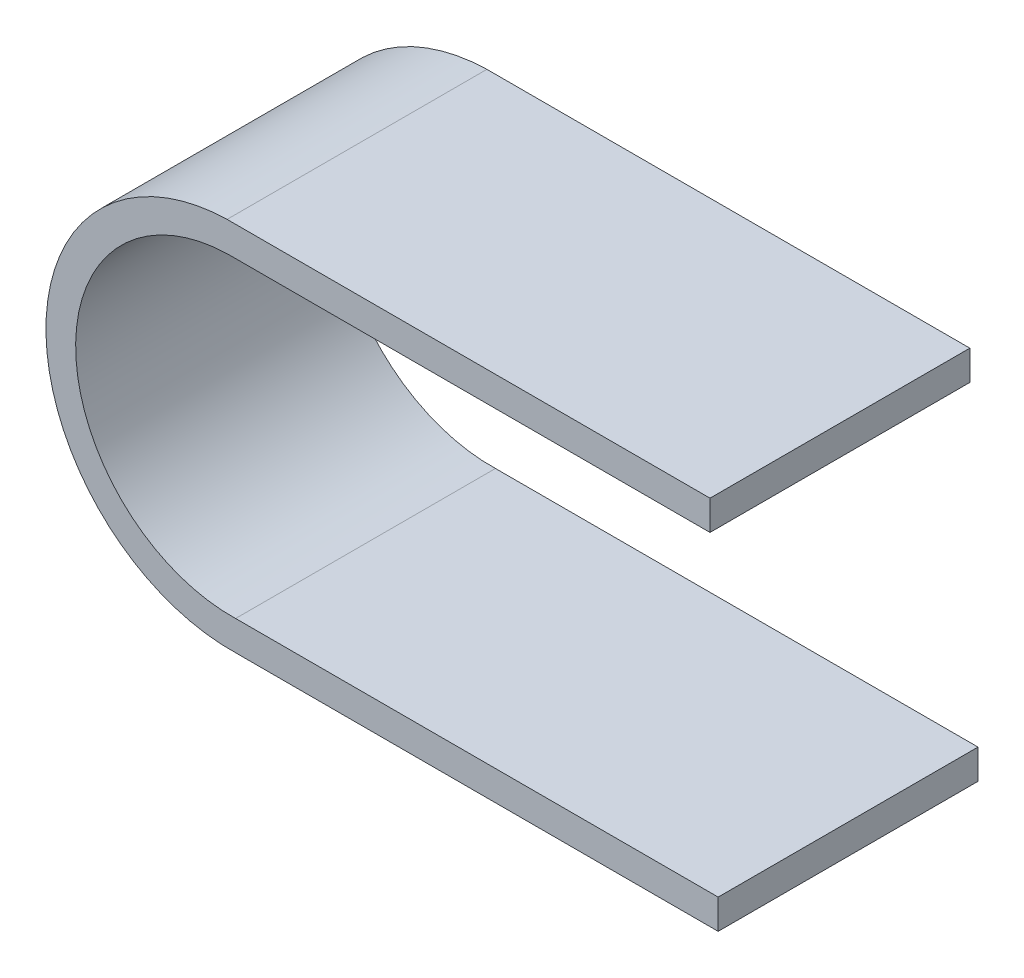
ISO-10303-21;
HEADER;
FILE_DESCRIPTION(('STEP AP214'),'2;1');
FILE_NAME('part.step','',(''),(''),'','','');
FILE_SCHEMA(('AUTOMOTIVE_DESIGN { 1 0 10303 214 1 1 1 1 }'));
ENDSEC;
DATA;
#1=APPLICATION_CONTEXT('core data for automotive mechanical design processes');
#2=APPLICATION_PROTOCOL_DEFINITION('international standard','automotive_design',2000,#1);
#3=PRODUCT_CONTEXT('',#1,'mechanical');
#4=PRODUCT('Part','Part','',(#3));
#5=PRODUCT_RELATED_PRODUCT_CATEGORY('part','',(#4));
#6=PRODUCT_DEFINITION_FORMATION('','',#4);
#7=PRODUCT_DEFINITION_CONTEXT('part definition',#1,'design');
#8=PRODUCT_DEFINITION('design','',#6,#7);
#9=PRODUCT_DEFINITION_SHAPE('','',#8);
#10=(LENGTH_UNIT() NAMED_UNIT(*) SI_UNIT(.MILLI.,.METRE.));
#11=(NAMED_UNIT(*) PLANE_ANGLE_UNIT() SI_UNIT($,.RADIAN.));
#12=(NAMED_UNIT(*) SI_UNIT($,.STERADIAN.) SOLID_ANGLE_UNIT());
#13=UNCERTAINTY_MEASURE_WITH_UNIT(LENGTH_MEASURE(1.E-05),#10,'distance_accuracy_value','');
#14=(GEOMETRIC_REPRESENTATION_CONTEXT(3) GLOBAL_UNCERTAINTY_ASSIGNED_CONTEXT((#13)) GLOBAL_UNIT_ASSIGNED_CONTEXT((#10,
#11,#12)) REPRESENTATION_CONTEXT('',''));
#15=CARTESIAN_POINT('',(0.,0.,0.));
#16=DIRECTION('',(0.,0.,1.));
#17=DIRECTION('',(1.,0.,0.));
#18=AXIS2_PLACEMENT_3D('',#15,#16,#17);
#19=CARTESIAN_POINT('',(0.,0.,35.));
#20=DIRECTION('',(-1.,0.,0.));
#21=DIRECTION('',(0.,0.,1.));
#22=AXIS2_PLACEMENT_3D('',#19,#20,#21);
#23=PLANE('',#22);
#24=DIRECTION('',(0.,1.,0.));
#25=VECTOR('',#24,1.);
#26=CARTESIAN_POINT('',(0.,0.,0.));
#27=LINE('',#26,#25);
#28=CARTESIAN_POINT('',(0.,-4.,0.));
#29=VERTEX_POINT('',#28);
#30=CARTESIAN_POINT('',(0.,0.,0.));
#31=VERTEX_POINT('',#30);
#32=EDGE_CURVE('E129',#29,#31,#27,.T.);
#33=ORIENTED_EDGE('',*,*,#32,.T.);
#34=DIRECTION('',(0.,0.,-1.));
#35=VECTOR('',#34,1.);
#36=CARTESIAN_POINT('',(0.,0.,35.));
#37=LINE('',#36,#35);
#38=CARTESIAN_POINT('',(0.,0.,35.));
#39=VERTEX_POINT('',#38);
#40=EDGE_CURVE('E11',#39,#31,#37,.T.);
#41=ORIENTED_EDGE('',*,*,#40,.F.);
#42=DIRECTION('',(0.,1.,0.));
#43=VECTOR('',#42,1.);
#44=CARTESIAN_POINT('',(0.,0.,35.));
#45=LINE('',#44,#43);
#46=CARTESIAN_POINT('',(0.,-4.,35.));
#47=VERTEX_POINT('',#46);
#48=EDGE_CURVE('E143',#47,#39,#45,.T.);
#49=ORIENTED_EDGE('',*,*,#48,.F.);
#50=DIRECTION('',(0.,0.,-1.));
#51=VECTOR('',#50,1.);
#52=CARTESIAN_POINT('',(0.,-4.,35.));
#53=LINE('',#52,#51);
#54=EDGE_CURVE('E125',#47,#29,#53,.T.);
#55=ORIENTED_EDGE('',*,*,#54,.T.);
#56=EDGE_LOOP('',(#33,#41,#49,#55));
#57=FACE_BOUND('',#56,.T.);
#58=ADVANCED_FACE('F33',(#57),#23,.F.);
#59=CARTESIAN_POINT('',(0.,0.,35.));
#60=DIRECTION('',(0.,-1.,0.));
#61=DIRECTION('',(1.,0.,0.));
#62=AXIS2_PLACEMENT_3D('',#59,#60,#61);
#63=PLANE('',#62);
#64=DIRECTION('',(-1.,0.,0.));
#65=VECTOR('',#64,1.);
#66=CARTESIAN_POINT('',(0.,0.,0.));
#67=LINE('',#66,#65);
#68=CARTESIAN_POINT('',(-65.,0.,0.));
#69=VERTEX_POINT('',#68);
#70=EDGE_CURVE('E132',#31,#69,#67,.T.);
#71=ORIENTED_EDGE('',*,*,#70,.T.);
#72=DIRECTION('',(0.,0.,-1.));
#73=VECTOR('',#72,1.);
#74=CARTESIAN_POINT('',(-65.,0.,35.));
#75=LINE('',#74,#73);
#76=CARTESIAN_POINT('',(-65.,0.,35.));
#77=VERTEX_POINT('',#76);
#78=EDGE_CURVE('E41',#77,#69,#75,.T.);
#79=ORIENTED_EDGE('',*,*,#78,.F.);
#80=DIRECTION('',(-1.,0.,0.));
#81=VECTOR('',#80,1.);
#82=CARTESIAN_POINT('',(0.,0.,35.));
#83=LINE('',#82,#81);
#84=EDGE_CURVE('E92',#39,#77,#83,.T.);
#85=ORIENTED_EDGE('',*,*,#84,.F.);
#86=ORIENTED_EDGE('',*,*,#40,.T.);
#87=EDGE_LOOP('',(#71,#79,#85,#86));
#88=FACE_BOUND('',#87,.T.);
#89=ADVANCED_FACE('F178',(#88),#63,.F.);
#90=CARTESIAN_POINT('',(-65.549344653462,20.9928135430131,35.));
#91=DIRECTION('',(0.,0.,-1.));
#92=DIRECTION('',(-1.,0.,0.));
#93=AXIS2_PLACEMENT_3D('',#90,#91,#92);
#94=CYLINDRICAL_SURFACE('',#93,21.);
#95=CARTESIAN_POINT('',(-65.549344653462,20.9928135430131,0.));
#96=DIRECTION('',(0.,0.,-1.));
#97=DIRECTION('',(-1.,0.,0.));
#98=AXIS2_PLACEMENT_3D('',#95,#96,#97);
#99=CIRCLE('',#98,21.);
#100=CARTESIAN_POINT('',(-66.0986893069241,41.9856270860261,0.));
#101=VERTEX_POINT('',#100);
#102=EDGE_CURVE('E134',#69,#101,#99,.T.);
#103=ORIENTED_EDGE('',*,*,#102,.T.);
#104=DIRECTION('',(0.,0.,-1.));
#105=VECTOR('',#104,1.);
#106=CARTESIAN_POINT('',(-66.0986893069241,41.9856270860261,35.));
#107=LINE('',#106,#105);
#108=CARTESIAN_POINT('',(-66.0986893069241,41.9856270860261,35.));
#109=VERTEX_POINT('',#108);
#110=EDGE_CURVE('E150',#109,#101,#107,.T.);
#111=ORIENTED_EDGE('',*,*,#110,.F.);
#112=CARTESIAN_POINT('',(-65.549344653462,20.9928135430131,35.));
#113=DIRECTION('',(0.,0.,-1.));
#114=DIRECTION('',(-1.,0.,0.));
#115=AXIS2_PLACEMENT_3D('',#112,#113,#114);
#116=CIRCLE('',#115,21.);
#117=EDGE_CURVE('E158',#77,#109,#116,.T.);
#118=ORIENTED_EDGE('',*,*,#117,.F.);
#119=ORIENTED_EDGE('',*,*,#78,.T.);
#120=EDGE_LOOP('',(#103,#111,#118,#119));
#121=FACE_BOUND('',#120,.T.);
#122=ADVANCED_FACE('F156',(#121),#94,.F.);
#123=CARTESIAN_POINT('',(-1.09868930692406,41.9856270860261,35.));
#124=DIRECTION('',(0.,1.,0.));
#125=DIRECTION('',(-1.,0.,0.));
#126=AXIS2_PLACEMENT_3D('',#123,#124,#125);
#127=PLANE('',#126);
#128=DIRECTION('',(1.,0.,0.));
#129=VECTOR('',#128,1.);
#130=CARTESIAN_POINT('',(-1.09868930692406,41.9856270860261,0.));
#131=LINE('',#130,#129);
#132=CARTESIAN_POINT('',(-1.09868930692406,41.9856270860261,0.));
#133=VERTEX_POINT('',#132);
#134=EDGE_CURVE('E136',#101,#133,#131,.T.);
#135=ORIENTED_EDGE('',*,*,#134,.T.);
#136=DIRECTION('',(0.,0.,-1.));
#137=VECTOR('',#136,1.);
#138=CARTESIAN_POINT('',(-1.09868930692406,41.9856270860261,35.));
#139=LINE('',#138,#137);
#140=CARTESIAN_POINT('',(-1.09868930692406,41.9856270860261,35.));
#141=VERTEX_POINT('',#140);
#142=EDGE_CURVE('E147',#141,#133,#139,.T.);
#143=ORIENTED_EDGE('',*,*,#142,.F.);
#144=DIRECTION('',(1.,0.,0.));
#145=VECTOR('',#144,1.);
#146=CARTESIAN_POINT('',(-1.09868930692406,41.9856270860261,35.));
#147=LINE('',#146,#145);
#148=EDGE_CURVE('E170',#109,#141,#147,.T.);
#149=ORIENTED_EDGE('',*,*,#148,.F.);
#150=ORIENTED_EDGE('',*,*,#110,.T.);
#151=EDGE_LOOP('',(#135,#143,#149,#150));
#152=FACE_BOUND('',#151,.T.);
#153=ADVANCED_FACE('F166',(#152),#127,.F.);
#154=CARTESIAN_POINT('',(-1.09868930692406,45.9856270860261,35.));
#155=DIRECTION('',(-1.,0.,0.));
#156=DIRECTION('',(0.,-1.,0.));
#157=AXIS2_PLACEMENT_3D('',#154,#155,#156);
#158=PLANE('',#157);
#159=DIRECTION('',(0.,1.,0.));
#160=VECTOR('',#159,1.);
#161=CARTESIAN_POINT('',(-1.09868930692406,45.9856270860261,0.));
#162=LINE('',#161,#160);
#163=CARTESIAN_POINT('',(-1.09868930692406,45.9856270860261,0.));
#164=VERTEX_POINT('',#163);
#165=EDGE_CURVE('E138',#133,#164,#162,.T.);
#166=ORIENTED_EDGE('',*,*,#165,.T.);
#167=DIRECTION('',(0.,0.,-1.));
#168=VECTOR('',#167,1.);
#169=CARTESIAN_POINT('',(-1.09868930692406,45.9856270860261,35.));
#170=LINE('',#169,#168);
#171=CARTESIAN_POINT('',(-1.09868930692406,45.9856270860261,35.));
#172=VERTEX_POINT('',#171);
#173=EDGE_CURVE('E120',#172,#164,#170,.T.);
#174=ORIENTED_EDGE('',*,*,#173,.F.);
#175=DIRECTION('',(0.,1.,0.));
#176=VECTOR('',#175,1.);
#177=CARTESIAN_POINT('',(-1.09868930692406,45.9856270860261,35.));
#178=LINE('',#177,#176);
#179=EDGE_CURVE('E111',#141,#172,#178,.T.);
#180=ORIENTED_EDGE('',*,*,#179,.F.);
#181=ORIENTED_EDGE('',*,*,#142,.T.);
#182=EDGE_LOOP('',(#166,#174,#180,#181));
#183=FACE_BOUND('',#182,.T.);
#184=ADVANCED_FACE('F169',(#183),#158,.F.);
#185=CARTESIAN_POINT('',(-1.09868930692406,45.9856270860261,35.));
#186=DIRECTION('',(0.,-1.,0.));
#187=DIRECTION('',(1.,0.,0.));
#188=AXIS2_PLACEMENT_3D('',#185,#186,#187);
#189=PLANE('',#188);
#190=DIRECTION('',(-1.,0.,0.));
#191=VECTOR('',#190,1.);
#192=CARTESIAN_POINT('',(-1.09868930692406,45.9856270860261,0.));
#193=LINE('',#192,#191);
#194=CARTESIAN_POINT('',(-66.1487370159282,45.9856270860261,0.));
#195=VERTEX_POINT('',#194);
#196=EDGE_CURVE('E119',#164,#195,#193,.T.);
#197=ORIENTED_EDGE('',*,*,#196,.T.);
#198=DIRECTION('',(0.,0.,-1.));
#199=VECTOR('',#198,1.);
#200=CARTESIAN_POINT('',(-66.1487370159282,45.9856270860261,35.));
#201=LINE('',#200,#199);
#202=CARTESIAN_POINT('',(-66.1487370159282,45.9856270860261,35.));
#203=VERTEX_POINT('',#202);
#204=EDGE_CURVE('E116',#203,#195,#201,.T.);
#205=ORIENTED_EDGE('',*,*,#204,.F.);
#206=DIRECTION('',(-1.,0.,0.));
#207=VECTOR('',#206,1.);
#208=CARTESIAN_POINT('',(-1.09868930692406,45.9856270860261,35.));
#209=LINE('',#208,#207);
#210=EDGE_CURVE('E105',#172,#203,#209,.T.);
#211=ORIENTED_EDGE('',*,*,#210,.F.);
#212=ORIENTED_EDGE('',*,*,#173,.T.);
#213=EDGE_LOOP('',(#197,#205,#211,#212));
#214=FACE_BOUND('',#213,.T.);
#215=ADVANCED_FACE('F117',(#214),#189,.F.);
#216=CARTESIAN_POINT('',(-65.549344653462,20.9928135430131,35.));
#217=DIRECTION('',(0.,0.,-1.));
#218=DIRECTION('',(-1.,0.,0.));
#219=AXIS2_PLACEMENT_3D('',#216,#217,#218);
#220=CYLINDRICAL_SURFACE('',#219,25.);
#221=CARTESIAN_POINT('',(-65.549344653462,20.9928135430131,0.));
#222=DIRECTION('',(0.,0.,1.));
#223=DIRECTION('',(-1.,0.,0.));
#224=AXIS2_PLACEMENT_3D('',#221,#222,#223);
#225=CIRCLE('',#224,25.);
#226=CARTESIAN_POINT('',(-64.9499522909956,-4.,0.));
#227=VERTEX_POINT('',#226);
#228=EDGE_CURVE('E78',#195,#227,#225,.T.);
#229=ORIENTED_EDGE('',*,*,#228,.T.);
#230=DIRECTION('',(0.,0.,-1.));
#231=VECTOR('',#230,1.);
#232=CARTESIAN_POINT('',(-64.9499522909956,-4.,35.));
#233=LINE('',#232,#231);
#234=CARTESIAN_POINT('',(-64.9499522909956,-4.,35.));
#235=VERTEX_POINT('',#234);
#236=EDGE_CURVE('E121',#235,#227,#233,.T.);
#237=ORIENTED_EDGE('',*,*,#236,.F.);
#238=CARTESIAN_POINT('',(-65.549344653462,20.9928135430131,35.));
#239=DIRECTION('',(0.,0.,1.));
#240=DIRECTION('',(-1.,0.,0.));
#241=AXIS2_PLACEMENT_3D('',#238,#239,#240);
#242=CIRCLE('',#241,25.);
#243=EDGE_CURVE('E109',#203,#235,#242,.T.);
#244=ORIENTED_EDGE('',*,*,#243,.F.);
#245=ORIENTED_EDGE('',*,*,#204,.T.);
#246=EDGE_LOOP('',(#229,#237,#244,#245));
#247=FACE_BOUND('',#246,.T.);
#248=ADVANCED_FACE('F123',(#247),#220,.T.);
#249=CARTESIAN_POINT('',(0.,-4.,35.));
#250=DIRECTION('',(0.,1.,0.));
#251=DIRECTION('',(0.,0.,1.));
#252=AXIS2_PLACEMENT_3D('',#249,#250,#251);
#253=PLANE('',#252);
#254=DIRECTION('',(1.,0.,0.));
#255=VECTOR('',#254,1.);
#256=CARTESIAN_POINT('',(0.,-4.,0.));
#257=LINE('',#256,#255);
#258=EDGE_CURVE('E84',#227,#29,#257,.T.);
#259=ORIENTED_EDGE('',*,*,#258,.T.);
#260=ORIENTED_EDGE('',*,*,#54,.F.);
#261=DIRECTION('',(1.,0.,0.));
#262=VECTOR('',#261,1.);
#263=CARTESIAN_POINT('',(0.,-4.,35.));
#264=LINE('',#263,#262);
#265=EDGE_CURVE('E49',#235,#47,#264,.T.);
#266=ORIENTED_EDGE('',*,*,#265,.F.);
#267=ORIENTED_EDGE('',*,*,#236,.T.);
#268=EDGE_LOOP('',(#259,#260,#266,#267));
#269=FACE_BOUND('',#268,.T.);
#270=ADVANCED_FACE('F194',(#269),#253,.F.);
#271=CARTESIAN_POINT('',(-65.549344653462,20.9928135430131,35.));
#272=DIRECTION('',(0.,0.,-1.));
#273=DIRECTION('',(-1.,0.,0.));
#274=AXIS2_PLACEMENT_3D('',#271,#272,#273);
#275=PLANE('',#274);
#276=ORIENTED_EDGE('',*,*,#48,.T.);
#277=ORIENTED_EDGE('',*,*,#84,.T.);
#278=ORIENTED_EDGE('',*,*,#117,.T.);
#279=ORIENTED_EDGE('',*,*,#148,.T.);
#280=ORIENTED_EDGE('',*,*,#179,.T.);
#281=ORIENTED_EDGE('',*,*,#210,.T.);
#282=ORIENTED_EDGE('',*,*,#243,.T.);
#283=ORIENTED_EDGE('',*,*,#265,.T.);
#284=EDGE_LOOP('',(#276,#277,#278,#279,#280,#281,#282,#283));
#285=FACE_BOUND('',#284,.T.);
#286=ADVANCED_FACE('F107',(#285),#275,.F.);
#287=CARTESIAN_POINT('',(-65.549344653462,20.9928135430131,0.));
#288=DIRECTION('',(0.,0.,-1.));
#289=DIRECTION('',(-1.,0.,0.));
#290=AXIS2_PLACEMENT_3D('',#287,#288,#289);
#291=PLANE('',#290);
#292=ORIENTED_EDGE('',*,*,#32,.F.);
#293=ORIENTED_EDGE('',*,*,#258,.F.);
#294=ORIENTED_EDGE('',*,*,#228,.F.);
#295=ORIENTED_EDGE('',*,*,#196,.F.);
#296=ORIENTED_EDGE('',*,*,#165,.F.);
#297=ORIENTED_EDGE('',*,*,#134,.F.);
#298=ORIENTED_EDGE('',*,*,#102,.F.);
#299=ORIENTED_EDGE('',*,*,#70,.F.);
#300=EDGE_LOOP('',(#292,#293,#294,#295,#296,#297,#298,#299));
#301=FACE_BOUND('',#300,.T.);
#302=ADVANCED_FACE('F162',(#301),#291,.T.);
#303=CLOSED_SHELL('',(#58,#89,#122,#153,#184,#215,#248,#270,#286,#302));
#304=MANIFOLD_SOLID_BREP('B2',#303);
#305=ADVANCED_BREP_SHAPE_REPRESENTATION('',(#18,#304),#14);
#306=SHAPE_DEFINITION_REPRESENTATION(#9,#305);
ENDSEC;
END-ISO-10303-21;
